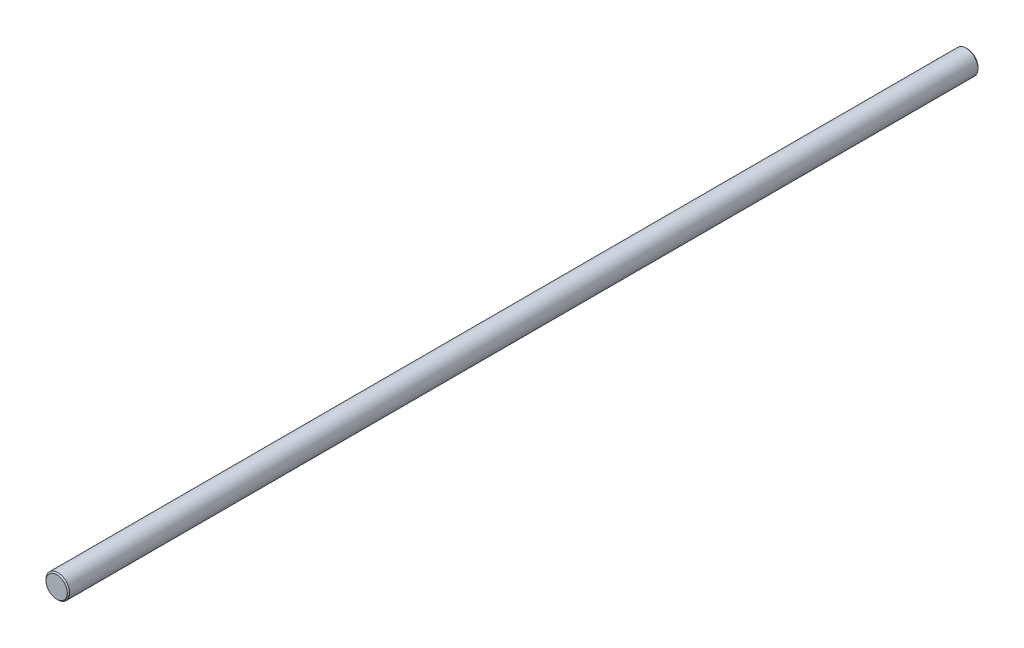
ISO-10303-21;
HEADER;
FILE_DESCRIPTION(('STEP AP214'),'2;1');
FILE_NAME('part.step','',(''),(''),'','','');
FILE_SCHEMA(('AUTOMOTIVE_DESIGN { 1 0 10303 214 1 1 1 1 }'));
ENDSEC;
DATA;
#1=APPLICATION_CONTEXT('core data for automotive mechanical design processes');
#2=APPLICATION_PROTOCOL_DEFINITION('international standard','automotive_design',2000,#1);
#3=PRODUCT_CONTEXT('',#1,'mechanical');
#4=PRODUCT('Part','Part','',(#3));
#5=PRODUCT_RELATED_PRODUCT_CATEGORY('part','',(#4));
#6=PRODUCT_DEFINITION_FORMATION('','',#4);
#7=PRODUCT_DEFINITION_CONTEXT('part definition',#1,'design');
#8=PRODUCT_DEFINITION('design','',#6,#7);
#9=PRODUCT_DEFINITION_SHAPE('','',#8);
#10=(LENGTH_UNIT() NAMED_UNIT(*) SI_UNIT(.MILLI.,.METRE.));
#11=(NAMED_UNIT(*) PLANE_ANGLE_UNIT() SI_UNIT($,.RADIAN.));
#12=(NAMED_UNIT(*) SI_UNIT($,.STERADIAN.) SOLID_ANGLE_UNIT());
#13=UNCERTAINTY_MEASURE_WITH_UNIT(LENGTH_MEASURE(1.E-05),#10,'distance_accuracy_value','');
#14=(GEOMETRIC_REPRESENTATION_CONTEXT(3) GLOBAL_UNCERTAINTY_ASSIGNED_CONTEXT((#13)) GLOBAL_UNIT_ASSIGNED_CONTEXT((#10,
#11,#12)) REPRESENTATION_CONTEXT('',''));
#15=CARTESIAN_POINT('',(0.,0.,0.));
#16=DIRECTION('',(0.,0.,1.));
#17=DIRECTION('',(1.,0.,0.));
#18=AXIS2_PLACEMENT_3D('',#15,#16,#17);
#19=CARTESIAN_POINT('',(0.,0.,770.));
#20=DIRECTION('',(0.,0.,-1.));
#21=DIRECTION('',(-1.,0.,0.));
#22=AXIS2_PLACEMENT_3D('',#19,#20,#21);
#23=CYLINDRICAL_SURFACE('',#22,10.);
#24=CARTESIAN_POINT('',(0.,0.,769.));
#25=DIRECTION('',(0.,0.,1.));
#26=DIRECTION('',(1.,0.,0.));
#27=AXIS2_PLACEMENT_3D('',#24,#25,#26);
#28=CIRCLE('',#27,10.);
#29=CARTESIAN_POINT('',(10.,0.,769.));
#30=VERTEX_POINT('',#29);
#31=EDGE_CURVE('E34',#30,#30,#28,.F.);
#32=ORIENTED_EDGE('',*,*,#31,.T.);
#33=EDGE_LOOP('',(#32));
#34=FACE_BOUND('',#33,.T.);
#35=CARTESIAN_POINT('',(0.,0.,0.99999999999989));
#36=DIRECTION('',(0.,0.,1.));
#37=DIRECTION('',(1.,0.,0.));
#38=AXIS2_PLACEMENT_3D('',#35,#36,#37);
#39=CIRCLE('',#38,10.);
#40=CARTESIAN_POINT('',(10.,0.,0.99999999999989));
#41=VERTEX_POINT('',#40);
#42=EDGE_CURVE('E38',#41,#41,#39,.T.);
#43=ORIENTED_EDGE('',*,*,#42,.T.);
#44=EDGE_LOOP('',(#43));
#45=FACE_BOUND('',#44,.T.);
#46=ADVANCED_FACE('F28',(#34,#45),#23,.T.);
#47=CARTESIAN_POINT('',(0.,0.,770.));
#48=DIRECTION('',(0.,0.,1.));
#49=DIRECTION('',(1.,0.,0.));
#50=AXIS2_PLACEMENT_3D('',#47,#48,#49);
#51=PLANE('',#50);
#52=CARTESIAN_POINT('',(0.,0.,770.));
#53=DIRECTION('',(0.,0.,1.));
#54=DIRECTION('',(1.,0.,0.));
#55=AXIS2_PLACEMENT_3D('',#52,#53,#54);
#56=CIRCLE('',#55,8.9999999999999);
#57=CARTESIAN_POINT('',(8.9999999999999,0.,770.));
#58=VERTEX_POINT('',#57);
#59=EDGE_CURVE('E42',#58,#58,#56,.T.);
#60=ORIENTED_EDGE('',*,*,#59,.T.);
#61=EDGE_LOOP('',(#60));
#62=FACE_BOUND('',#61,.T.);
#63=ADVANCED_FACE('F48',(#62),#51,.T.);
#64=CARTESIAN_POINT('',(0.,0.,0.));
#65=DIRECTION('',(0.,0.,1.));
#66=DIRECTION('',(1.,0.,0.));
#67=AXIS2_PLACEMENT_3D('',#64,#65,#66);
#68=PLANE('',#67);
#69=CARTESIAN_POINT('',(0.,0.,0.));
#70=DIRECTION('',(0.,0.,1.));
#71=DIRECTION('',(1.,0.,0.));
#72=AXIS2_PLACEMENT_3D('',#69,#70,#71);
#73=CIRCLE('',#72,9.00000000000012);
#74=CARTESIAN_POINT('',(9.00000000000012,0.,0.));
#75=VERTEX_POINT('',#74);
#76=EDGE_CURVE('E10',#75,#75,#73,.F.);
#77=ORIENTED_EDGE('',*,*,#76,.T.);
#78=EDGE_LOOP('',(#77));
#79=FACE_BOUND('',#78,.T.);
#80=ADVANCED_FACE('F53',(#79),#68,.F.);
#81=CARTESIAN_POINT('',(0.,0.,770.));
#82=DIRECTION('',(0.,0.,-1.));
#83=DIRECTION('',(-1.,0.,0.));
#84=AXIS2_PLACEMENT_3D('',#81,#82,#83);
#85=CONICAL_SURFACE('',#84,8.9999999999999,0.785398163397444);
#86=ORIENTED_EDGE('',*,*,#31,.F.);
#87=EDGE_LOOP('',(#86));
#88=FACE_BOUND('',#87,.T.);
#89=ORIENTED_EDGE('',*,*,#59,.F.);
#90=EDGE_LOOP('',(#89));
#91=FACE_BOUND('',#90,.T.);
#92=ADVANCED_FACE('F50',(#88,#91),#85,.T.);
#93=CARTESIAN_POINT('',(0.,0.,0.99999999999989));
#94=DIRECTION('',(0.,0.,1.));
#95=DIRECTION('',(1.,0.,0.));
#96=AXIS2_PLACEMENT_3D('',#93,#94,#95);
#97=CONICAL_SURFACE('',#96,10.,0.785398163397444);
#98=ORIENTED_EDGE('',*,*,#76,.F.);
#99=EDGE_LOOP('',(#98));
#100=FACE_BOUND('',#99,.T.);
#101=ORIENTED_EDGE('',*,*,#42,.F.);
#102=EDGE_LOOP('',(#101));
#103=FACE_BOUND('',#102,.T.);
#104=ADVANCED_FACE('F52',(#100,#103),#97,.T.);
#105=CLOSED_SHELL('',(#46,#63,#80,#92,#104));
#106=MANIFOLD_SOLID_BREP('B2',#105);
#107=ADVANCED_BREP_SHAPE_REPRESENTATION('',(#18,#106),#14);
#108=SHAPE_DEFINITION_REPRESENTATION(#9,#107);
ENDSEC;
END-ISO-10303-21;
